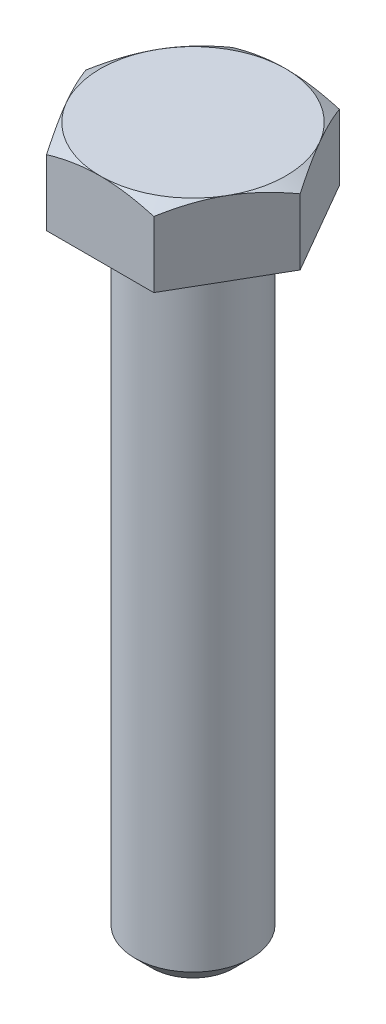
ISO-10303-21;
HEADER;
FILE_DESCRIPTION(('STEP AP214'),'2;1');
FILE_NAME('part.step','',(''),(''),'','','');
FILE_SCHEMA(('AUTOMOTIVE_DESIGN { 1 0 10303 214 1 1 1 1 }'));
ENDSEC;
DATA;
#1=APPLICATION_CONTEXT('core data for automotive mechanical design processes');
#2=APPLICATION_PROTOCOL_DEFINITION('international standard','automotive_design',2000,#1);
#3=PRODUCT_CONTEXT('',#1,'mechanical');
#4=PRODUCT('Part','Part','',(#3));
#5=PRODUCT_RELATED_PRODUCT_CATEGORY('part','',(#4));
#6=PRODUCT_DEFINITION_FORMATION('','',#4);
#7=PRODUCT_DEFINITION_CONTEXT('part definition',#1,'design');
#8=PRODUCT_DEFINITION('design','',#6,#7);
#9=PRODUCT_DEFINITION_SHAPE('','',#8);
#10=(LENGTH_UNIT() NAMED_UNIT(*) SI_UNIT(.MILLI.,.METRE.));
#11=(NAMED_UNIT(*) PLANE_ANGLE_UNIT() SI_UNIT($,.RADIAN.));
#12=(NAMED_UNIT(*) SI_UNIT($,.STERADIAN.) SOLID_ANGLE_UNIT());
#13=UNCERTAINTY_MEASURE_WITH_UNIT(LENGTH_MEASURE(1.E-05),#10,'distance_accuracy_value','');
#14=(GEOMETRIC_REPRESENTATION_CONTEXT(3) GLOBAL_UNCERTAINTY_ASSIGNED_CONTEXT((#13)) GLOBAL_UNIT_ASSIGNED_CONTEXT((#10,
#11,#12)) REPRESENTATION_CONTEXT('',''));
#15=CARTESIAN_POINT('',(0.,0.,0.));
#16=DIRECTION('',(0.,0.,1.));
#17=DIRECTION('',(1.,0.,0.));
#18=AXIS2_PLACEMENT_3D('',#15,#16,#17);
#19=CARTESIAN_POINT('',(0.,0.,0.));
#20=DIRECTION('',(0.,1.,0.));
#21=DIRECTION('',(0.,0.,1.));
#22=AXIS2_PLACEMENT_3D('',#19,#20,#21);
#23=PLANE('',#22);
#24=CARTESIAN_POINT('',(0.,0.,0.));
#25=DIRECTION('',(0.,1.,0.));
#26=DIRECTION('',(0.,0.,1.));
#27=AXIS2_PLACEMENT_3D('',#24,#25,#26);
#28=CIRCLE('',#27,5.);
#29=CARTESIAN_POINT('',(0.,0.,5.));
#30=VERTEX_POINT('',#29);
#31=EDGE_CURVE('E188',#30,#30,#28,.T.);
#32=ORIENTED_EDGE('',*,*,#31,.T.);
#33=EDGE_LOOP('',(#32));
#34=FACE_BOUND('',#33,.T.);
#35=DIRECTION('',(0.499999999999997,0.,0.86602540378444));
#36=VECTOR('',#35,1.);
#37=CARTESIAN_POINT('',(4.61880215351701,0.,-8.00000000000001));
#38=LINE('',#37,#36);
#39=CARTESIAN_POINT('',(4.61880215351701,0.,-8.00000000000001));
#40=VERTEX_POINT('',#39);
#41=CARTESIAN_POINT('',(9.23760430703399,0.,-2.27595720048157E-12));
#42=VERTEX_POINT('',#41);
#43=EDGE_CURVE('E125',#40,#42,#38,.T.);
#44=ORIENTED_EDGE('',*,*,#43,.T.);
#45=DIRECTION('',(-0.499999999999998,0.,0.86602540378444));
#46=VECTOR('',#45,1.);
#47=CARTESIAN_POINT('',(4.61880215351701,0.,8.00000000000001));
#48=LINE('',#47,#46);
#49=CARTESIAN_POINT('',(4.61880215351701,0.,8.00000000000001));
#50=VERTEX_POINT('',#49);
#51=EDGE_CURVE('E123',#42,#50,#48,.T.);
#52=ORIENTED_EDGE('',*,*,#51,.T.);
#53=DIRECTION('',(-1.,0.,0.));
#54=VECTOR('',#53,1.);
#55=CARTESIAN_POINT('',(-4.61880215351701,0.,7.99999999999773));
#56=LINE('',#55,#54);
#57=CARTESIAN_POINT('',(-4.61880215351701,0.,7.99999999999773));
#58=VERTEX_POINT('',#57);
#59=EDGE_CURVE('E53',#50,#58,#56,.T.);
#60=ORIENTED_EDGE('',*,*,#59,.T.);
#61=DIRECTION('',(-0.499999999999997,0.,-0.86602540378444));
#62=VECTOR('',#61,1.);
#63=CARTESIAN_POINT('',(-4.61880215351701,0.,7.99999999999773));
#64=LINE('',#63,#62);
#65=CARTESIAN_POINT('',(-9.23760430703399,5.68989300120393E-13,0.));
#66=VERTEX_POINT('',#65);
#67=EDGE_CURVE('E112',#58,#66,#64,.T.);
#68=ORIENTED_EDGE('',*,*,#67,.T.);
#69=DIRECTION('',(0.499999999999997,0.,-0.86602540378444));
#70=VECTOR('',#69,1.);
#71=CARTESIAN_POINT('',(-4.61880215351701,5.68989300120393E-13,-8.00000000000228));
#72=LINE('',#71,#70);
#73=CARTESIAN_POINT('',(-4.61880215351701,5.68989300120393E-13,-8.00000000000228));
#74=VERTEX_POINT('',#73);
#75=EDGE_CURVE('E118',#66,#74,#72,.T.);
#76=ORIENTED_EDGE('',*,*,#75,.T.);
#77=DIRECTION('',(1.,0.,0.));
#78=VECTOR('',#77,1.);
#79=CARTESIAN_POINT('',(-4.61880215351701,5.68989300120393E-13,-8.00000000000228));
#80=LINE('',#79,#78);
#81=EDGE_CURVE('E130',#74,#40,#80,.T.);
#82=ORIENTED_EDGE('',*,*,#81,.T.);
#83=EDGE_LOOP('',(#44,#52,#60,#68,#76,#82));
#84=FACE_BOUND('',#83,.T.);
#85=ADVANCED_FACE('F30',(#34,#84),#23,.F.);
#86=CARTESIAN_POINT('',(-1.13797860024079E-12,-55.,0.));
#87=DIRECTION('',(0.,1.,0.));
#88=DIRECTION('',(0.,0.,1.));
#89=AXIS2_PLACEMENT_3D('',#86,#87,#88);
#90=CYLINDRICAL_SURFACE('',#89,5.);
#91=CARTESIAN_POINT('',(0.,-53.5,0.));
#92=DIRECTION('',(0.,1.,0.));
#93=DIRECTION('',(0.,0.,1.));
#94=AXIS2_PLACEMENT_3D('',#91,#92,#93);
#95=CIRCLE('',#94,5.);
#96=CARTESIAN_POINT('',(0.,-53.5,5.));
#97=VERTEX_POINT('',#96);
#98=EDGE_CURVE('E38',#97,#97,#95,.T.);
#99=ORIENTED_EDGE('',*,*,#98,.T.);
#100=EDGE_LOOP('',(#99));
#101=FACE_BOUND('',#100,.T.);
#102=ORIENTED_EDGE('',*,*,#31,.F.);
#103=EDGE_LOOP('',(#102));
#104=FACE_BOUND('',#103,.T.);
#105=ADVANCED_FACE('F32',(#101,#104),#90,.T.);
#106=CARTESIAN_POINT('',(-1.13797860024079E-12,-55.,0.));
#107=DIRECTION('',(0.,1.,0.));
#108=DIRECTION('',(0.,0.,1.));
#109=AXIS2_PLACEMENT_3D('',#106,#107,#108);
#110=PLANE('',#109);
#111=CARTESIAN_POINT('',(-1.13797860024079E-12,-55.,0.));
#112=DIRECTION('',(0.,1.,0.));
#113=DIRECTION('',(0.,0.,1.));
#114=AXIS2_PLACEMENT_3D('',#111,#112,#113);
#115=CIRCLE('',#114,3.49999999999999);
#116=CARTESIAN_POINT('',(-1.13797860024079E-12,-55.,3.49999999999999));
#117=VERTEX_POINT('',#116);
#118=EDGE_CURVE('E11',#117,#117,#115,.F.);
#119=ORIENTED_EDGE('',*,*,#118,.T.);
#120=EDGE_LOOP('',(#119));
#121=FACE_BOUND('',#120,.T.);
#122=ADVANCED_FACE('F198',(#121),#110,.F.);
#123=CARTESIAN_POINT('',(0.,-53.5,0.));
#124=DIRECTION('',(0.,1.,0.));
#125=DIRECTION('',(0.,0.,1.));
#126=AXIS2_PLACEMENT_3D('',#123,#124,#125);
#127=CONICAL_SURFACE('',#126,5.,0.785398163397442);
#128=ORIENTED_EDGE('',*,*,#118,.F.);
#129=EDGE_LOOP('',(#128));
#130=FACE_BOUND('',#129,.T.);
#131=ORIENTED_EDGE('',*,*,#98,.F.);
#132=EDGE_LOOP('',(#131));
#133=FACE_BOUND('',#132,.T.);
#134=ADVANCED_FACE('F168',(#130,#133),#127,.T.);
#135=CARTESIAN_POINT('',(4.6188021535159,6.4,-8.00000000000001));
#136=DIRECTION('',(0.86602540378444,0.,-0.499999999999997));
#137=DIRECTION('',(-0.499999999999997,0.,-0.86602540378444));
#138=AXIS2_PLACEMENT_3D('',#135,#136,#137);
#139=PLANE('',#138);
#140=CARTESIAN_POINT('',(4.61868668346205,5.68540215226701,-8.00020000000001));
#141=CARTESIAN_POINT('',(4.72021302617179,5.74400928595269,-7.8243512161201));
#142=CARTESIAN_POINT('',(4.82211789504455,5.7999565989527,-7.64784680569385));
#143=CARTESIAN_POINT('',(5.02675523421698,5.90579899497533,-7.29340453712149));
#144=CARTESIAN_POINT('',(5.12948804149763,5.95569146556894,-7.11546609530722));
#145=CARTESIAN_POINT('',(5.43933133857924,6.09530720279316,-6.5788017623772));
#146=CARTESIAN_POINT('',(5.64766491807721,6.17471882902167,-6.21795741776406));
#147=CARTESIAN_POINT('',(5.95943209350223,6.26783835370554,-5.67796082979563));
#148=CARTESIAN_POINT('',(6.06193429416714,6.2943654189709,-5.50042181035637));
#149=CARTESIAN_POINT('',(6.26740224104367,6.33884682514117,-5.14454088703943));
#150=CARTESIAN_POINT('',(6.3703679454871,6.35680192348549,-4.9661990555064));
#151=CARTESIAN_POINT('',(6.57647664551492,6.3836843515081,-4.60920831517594));
#152=CARTESIAN_POINT('',(6.67961930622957,6.3926219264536,-4.43055998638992));
#153=CARTESIAN_POINT('',(6.88599991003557,6.40127769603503,-4.07309829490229));
#154=CARTESIAN_POINT('',(6.98923785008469,6.40099617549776,-3.89428493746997));
#155=CARTESIAN_POINT('',(7.18224506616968,6.39185497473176,-3.55998663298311));
#156=CARTESIAN_POINT('',(7.27202796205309,6.38411039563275,-3.40447809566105));
#157=CARTESIAN_POINT('',(7.45138347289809,6.36179886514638,-3.09382523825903));
#158=CARTESIAN_POINT('',(7.54095607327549,6.34723145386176,-2.93868094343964));
#159=CARTESIAN_POINT('',(7.80932710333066,6.29363930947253,-2.47384868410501));
#160=CARTESIAN_POINT('',(7.98765049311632,6.24473135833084,-2.16498351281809));
#161=CARTESIAN_POINT('',(8.34618890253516,6.12246059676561,-1.54397677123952));
#162=CARTESIAN_POINT('',(8.52635816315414,6.04857947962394,-1.23191445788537));
#163=CARTESIAN_POINT('',(8.88400987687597,5.88089985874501,-0.612443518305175));
#164=CARTESIAN_POINT('',(9.0614969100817,5.78714073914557,-0.305026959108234));
#165=CARTESIAN_POINT('',(9.23771977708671,5.68540215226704,0.000200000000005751));
#166=B_SPLINE_CURVE_WITH_KNOTS('',3,(#140,#141,#142,#143,#144,#145,#146,#147,#148,#149,#150,
#151,#152,#153,#154,#155,#156,#157,#158,#159,#160,#161,#162,#163,#164,#165),.UNSPECIFIED.,.F.,
.F.,(4,2,2,2,2,2,2,2,2,2,2,2,4),(0.,0.63397354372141,1.26821965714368,2.53934712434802,
3.15934343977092,3.77928496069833,4.3985213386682,5.01773858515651,5.55680239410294,
6.09590254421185,7.17487077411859,8.2777685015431,9.37850115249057),.UNSPECIFIED.);
#167=CARTESIAN_POINT('',(4.6188021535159,5.68546882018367,-8.00000000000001));
#168=VERTEX_POINT('',#167);
#169=CARTESIAN_POINT('',(6.92820323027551,6.40000000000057,-4.));
#170=VERTEX_POINT('',#169);
#171=EDGE_CURVE('E177',#168,#170,#166,.T.);
#172=ORIENTED_EDGE('',*,*,#171,.T.);
#173=CARTESIAN_POINT('',(9.23760430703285,5.68546882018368,0.));
#174=VERTEX_POINT('',#173);
#175=EDGE_CURVE('E171',#170,#174,#166,.T.);
#176=ORIENTED_EDGE('',*,*,#175,.T.);
#177=DIRECTION('',(0.,-1.,0.));
#178=VECTOR('',#177,1.);
#179=CARTESIAN_POINT('',(9.23760430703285,6.4,0.));
#180=LINE('',#179,#178);
#181=EDGE_CURVE('E133',#174,#42,#180,.T.);
#182=ORIENTED_EDGE('',*,*,#181,.T.);
#183=ORIENTED_EDGE('',*,*,#43,.F.);
#184=DIRECTION('',(0.,-1.,0.));
#185=VECTOR('',#184,1.);
#186=CARTESIAN_POINT('',(4.6188021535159,6.4,-8.00000000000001));
#187=LINE('',#186,#185);
#188=EDGE_CURVE('E134',#168,#40,#187,.T.);
#189=ORIENTED_EDGE('',*,*,#188,.F.);
#190=EDGE_LOOP('',(#172,#176,#182,#183,#189));
#191=FACE_BOUND('',#190,.T.);
#192=ADVANCED_FACE('F164',(#191),#139,.T.);
#193=CARTESIAN_POINT('',(-4.61880215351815,6.40000000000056,-8.00000000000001));
#194=DIRECTION('',(0.,0.,-1.));
#195=DIRECTION('',(-1.,0.,0.));
#196=AXIS2_PLACEMENT_3D('',#193,#194,#195);
#197=PLANE('',#196);
#198=CARTESIAN_POINT('',(-12.4167804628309,2.49087866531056,-8.00000000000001));
#199=CARTESIAN_POINT('',(-12.0672904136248,2.66045330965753,-8.00000000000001));
#200=CARTESIAN_POINT('',(-11.7169991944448,2.82840496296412,-8.00000000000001));
#201=CARTESIAN_POINT('',(-11.0143883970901,3.16014971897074,-8.00000000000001));
#202=CARTESIAN_POINT('',(-10.6620685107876,3.32394216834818,-8.00000000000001));
#203=CARTESIAN_POINT('',(-9.95316388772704,3.64727784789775,-8.00000000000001));
#204=CARTESIAN_POINT('',(-9.59656638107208,3.80679317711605,-8.00000000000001));
#205=CARTESIAN_POINT('',(-8.88053881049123,4.11930971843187,-8.00000000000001));
#206=CARTESIAN_POINT('',(-8.52110888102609,4.27231123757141,-8.));
#207=CARTESIAN_POINT('',(-7.78718796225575,4.57488649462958,-8.00000000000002));
#208=CARTESIAN_POINT('',(-7.41258513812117,4.72419046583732,-8.00000000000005));
#209=CARTESIAN_POINT('',(-6.65900148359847,5.01152306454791,-7.99999999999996));
#210=CARTESIAN_POINT('',(-6.2800201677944,5.14955042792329,-7.99999999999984));
#211=CARTESIAN_POINT('',(-5.51777814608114,5.41071323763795,-8.00000000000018));
#212=CARTESIAN_POINT('',(-5.13452785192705,5.53387874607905,-8.00000000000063));
#213=CARTESIAN_POINT('',(-4.362543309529,5.76137385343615,-7.99999999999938));
#214=CARTESIAN_POINT('',(-3.97381082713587,5.86570937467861,-7.99999999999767));
#215=CARTESIAN_POINT('',(-3.19274508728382,6.04997949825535,-7.99999999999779));
#216=CARTESIAN_POINT('',(-2.80044412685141,6.13004730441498,-7.9999999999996));
#217=CARTESIAN_POINT('',(-2.20841205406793,6.22848907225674,-8.00000000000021));
#218=CARTESIAN_POINT('',(-2.01045675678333,6.25769433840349,-8.00000000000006));
#219=CARTESIAN_POINT('',(-1.6135587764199,6.30831227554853,-7.99999999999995));
#220=CARTESIAN_POINT('',(-1.41461619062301,6.32972569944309,-7.99999999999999));
#221=CARTESIAN_POINT('',(-1.01861322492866,6.36406427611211,-8.00000000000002));
#222=CARTESIAN_POINT('',(-0.821562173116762,6.37709657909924,-8.00000000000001));
#223=CARTESIAN_POINT('',(-0.427085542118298,6.39481615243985,-8.));
#224=CARTESIAN_POINT('',(-0.229659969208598,6.39950356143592,-8.00000000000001));
#225=CARTESIAN_POINT('',(0.165212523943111,6.40042150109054,-8.00000000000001));
#226=CARTESIAN_POINT('',(0.362659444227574,6.39665201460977,-8.00000000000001));
#227=CARTESIAN_POINT('',(0.757218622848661,6.38074842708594,-8.00000000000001));
#228=CARTESIAN_POINT('',(0.954330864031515,6.3686139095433,-8.00000000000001));
#229=CARTESIAN_POINT('',(1.42775543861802,6.32968039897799,-8.00000000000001));
#230=CARTESIAN_POINT('',(1.70374960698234,6.29892889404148,-8.00000000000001));
#231=CARTESIAN_POINT('',(2.25368309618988,6.2227015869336,-8.00000000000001));
#232=CARTESIAN_POINT('',(2.52762213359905,6.1772237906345,-8.00000000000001));
#233=CARTESIAN_POINT('',(3.34604792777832,6.02111296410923,-8.00000000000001));
#234=CARTESIAN_POINT('',(3.88683599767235,5.8908311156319,-8.00000000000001));
#235=CARTESIAN_POINT('',(4.69544521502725,5.66499176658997,-8.00000000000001));
#236=CARTESIAN_POINT('',(4.96746298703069,5.58359647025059,-8.00000000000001));
#237=CARTESIAN_POINT('',(5.50885654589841,5.41237041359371,-8.00000000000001));
#238=CARTESIAN_POINT('',(5.77823231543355,5.32253959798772,-8.00000000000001));
#239=CARTESIAN_POINT('',(6.31442665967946,5.13588222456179,-8.00000000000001));
#240=CARTESIAN_POINT('',(6.58124604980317,5.03905798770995,-8.00000000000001));
#241=CARTESIAN_POINT('',(7.11267570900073,4.83955111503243,-8.00000000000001));
#242=CARTESIAN_POINT('',(7.3772860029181,4.73686854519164,-8.00000000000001));
#243=CARTESIAN_POINT('',(7.99738819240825,4.48959410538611,-8.00000000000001));
#244=CARTESIAN_POINT('',(8.3520710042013,4.34297712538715,-8.00000000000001));
#245=CARTESIAN_POINT('',(9.05844726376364,4.04269024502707,-8.));
#246=CARTESIAN_POINT('',(9.41014053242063,3.88901992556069,-8.));
#247=CARTESIAN_POINT('',(10.1110881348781,3.57602605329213,-8.));
#248=CARTESIAN_POINT('',(10.460341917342,3.41670126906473,-8.));
#249=CARTESIAN_POINT('',(11.1567365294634,3.09352849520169,-8.));
#250=CARTESIAN_POINT('',(11.5038774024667,2.92968059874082,-8.));
#251=CARTESIAN_POINT('',(12.1967663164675,2.59812346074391,-8.));
#252=CARTESIAN_POINT('',(12.5425124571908,2.43041025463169,-8.));
#253=CARTESIAN_POINT('',(13.2325146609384,2.09194333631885,-8.));
#254=CARTESIAN_POINT('',(13.5767707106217,1.92118959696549,-8.));
#255=CARTESIAN_POINT('',(14.6075666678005,1.40521482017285,-8.));
#256=CARTESIAN_POINT('',(15.2922255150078,1.05623625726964,-8.00000000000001));
#257=CARTESIAN_POINT('',(16.6012396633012,0.380458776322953,-8.));
#258=CARTESIAN_POINT('',(17.2258861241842,0.0542213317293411,-7.99999999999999));
#259=CARTESIAN_POINT('',(18.4728403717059,-0.602741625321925,-8.00000000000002));
#260=CARTESIAN_POINT('',(19.0951480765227,-0.933467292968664,-8.00000000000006));
#261=CARTESIAN_POINT('',(20.3364010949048,-1.59751993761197,-7.99999999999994));
#262=CARTESIAN_POINT('',(20.9553509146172,-1.9308385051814,-7.99999999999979));
#263=CARTESIAN_POINT('',(22.1917524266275,-2.6001635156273,-8.00000000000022));
#264=CARTESIAN_POINT('',(22.8092041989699,-2.93616981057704,-8.0000000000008));
#265=CARTESIAN_POINT('',(23.4261034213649,-3.27318069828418,-8.00000000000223));
#266=B_SPLINE_CURVE_WITH_KNOTS('',3,(#198,#199,#200,#201,#202,#203,#204,#205,#206,#207,#208,
#209,#210,#211,#212,#213,#214,#215,#216,#217,#218,#219,#220,#221,#222,#223,#224,#225,#226,#227,
#228,#229,#230,#231,#232,#233,#234,#235,#236,#237,#238,#239,#240,#241,#242,#243,#244,#245,#246,
#247,#248,#249,#250,#251,#252,#253,#254,#255,#256,#257,#258,#259,#260,#261,#262,#263,#264,#265),
.UNSPECIFIED.,.F.,.F.,(4,2,2,2,2,2,2,2,2,2,2,2,2,2,2,2,2,2,2,2,2,2,2,2,2,2,2,2,2,2,2,2,2,4),(0.,
1.16538522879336,2.33095239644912,3.50284826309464,4.6746888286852,5.88432915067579,
7.09410488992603,8.30139098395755,9.50829670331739,10.7084525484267,11.3086176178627,
11.9087246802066,12.5009984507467,13.0932623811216,13.6855275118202,14.2778221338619,
15.1104579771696,15.9432066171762,17.6096258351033,18.461358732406,19.3130972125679,
20.1645543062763,21.0160018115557,22.167276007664,23.3186187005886,24.4702136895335,
25.6217849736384,26.7745951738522,27.927415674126,30.2327531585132,32.3468591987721,
34.4610385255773,36.5700125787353,38.6788713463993),.UNSPECIFIED.);
#267=CARTESIAN_POINT('',(-4.61880215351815,5.68546882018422,-8.00000000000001));
#268=VERTEX_POINT('',#267);
#269=CARTESIAN_POINT('',(-1.13797860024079E-12,6.4,-8.00000000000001));
#270=VERTEX_POINT('',#269);
#271=EDGE_CURVE('E178',#268,#270,#266,.T.);
#272=ORIENTED_EDGE('',*,*,#271,.T.);
#273=EDGE_CURVE('E179',#270,#168,#266,.T.);
#274=ORIENTED_EDGE('',*,*,#273,.T.);
#275=ORIENTED_EDGE('',*,*,#188,.T.);
#276=ORIENTED_EDGE('',*,*,#81,.F.);
#277=DIRECTION('',(0.,-1.,0.));
#278=VECTOR('',#277,1.);
#279=CARTESIAN_POINT('',(-4.61880215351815,6.40000000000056,-8.00000000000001));
#280=LINE('',#279,#278);
#281=EDGE_CURVE('E137',#268,#74,#280,.T.);
#282=ORIENTED_EDGE('',*,*,#281,.F.);
#283=EDGE_LOOP('',(#272,#274,#275,#276,#282));
#284=FACE_BOUND('',#283,.T.);
#285=ADVANCED_FACE('F167',(#284),#197,.T.);
#286=CARTESIAN_POINT('',(-4.61880215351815,6.40000000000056,-8.00000000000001));
#287=DIRECTION('',(-0.86602540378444,0.,-0.499999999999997));
#288=DIRECTION('',(-0.499999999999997,0.,0.86602540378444));
#289=AXIS2_PLACEMENT_3D('',#286,#287,#288);
#290=PLANE('',#289);
#291=CARTESIAN_POINT('',(-9.23771977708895,5.68540215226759,0.000200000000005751));
#292=CARTESIAN_POINT('',(-9.13619343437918,5.74400928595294,-0.175648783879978));
#293=CARTESIAN_POINT('',(-9.03428856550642,5.79995659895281,-0.352153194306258));
#294=CARTESIAN_POINT('',(-8.82965122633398,5.90579899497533,-0.706595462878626));
#295=CARTESIAN_POINT('',(-8.72691841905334,5.95569146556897,-0.88453390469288));
#296=CARTESIAN_POINT('',(-8.41707512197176,6.09530720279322,-1.42119823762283));
#297=CARTESIAN_POINT('',(-8.20874154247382,6.17471882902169,-1.78204258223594));
#298=CARTESIAN_POINT('',(-7.89697436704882,6.26783835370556,-2.32203917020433));
#299=CARTESIAN_POINT('',(-7.79447216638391,6.29436541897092,-2.49957818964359));
#300=CARTESIAN_POINT('',(-7.58900421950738,6.33884682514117,-2.85545911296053));
#301=CARTESIAN_POINT('',(-7.48603851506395,6.35680192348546,-3.03380094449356));
#302=CARTESIAN_POINT('',(-7.27992981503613,6.38368435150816,-3.39079168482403));
#303=CARTESIAN_POINT('',(-7.17678715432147,6.39262192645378,-3.56944001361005));
#304=CARTESIAN_POINT('',(-6.97040655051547,6.40127769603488,-3.92690170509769));
#305=CARTESIAN_POINT('',(-6.86716861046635,6.40099617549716,-4.10571506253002));
#306=CARTESIAN_POINT('',(-6.67416139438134,6.39185497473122,-4.44001336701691));
#307=CARTESIAN_POINT('',(-6.58437849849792,6.38411039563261,-4.59552190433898));
#308=CARTESIAN_POINT('',(-6.4050229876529,6.36179886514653,-4.90617476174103));
#309=CARTESIAN_POINT('',(-6.31545038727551,6.34723145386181,-5.06131905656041));
#310=CARTESIAN_POINT('',(-6.04707935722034,6.29363930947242,-5.52615131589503));
#311=CARTESIAN_POINT('',(-5.86875596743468,6.24473135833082,-5.83501648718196));
#312=CARTESIAN_POINT('',(-5.51021755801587,6.12246059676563,-6.45602322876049));
#313=CARTESIAN_POINT('',(-5.33004829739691,6.04857947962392,-6.76808554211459));
#314=CARTESIAN_POINT('',(-4.97239658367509,5.88089985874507,-7.38755648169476));
#315=CARTESIAN_POINT('',(-4.79490955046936,5.78714073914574,-7.69497304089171));
#316=CARTESIAN_POINT('',(-4.61868668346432,5.68540215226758,-8.00020000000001));
#317=B_SPLINE_CURVE_WITH_KNOTS('',3,(#291,#292,#293,#294,#295,#296,#297,#298,#299,#300,#301,
#302,#303,#304,#305,#306,#307,#308,#309,#310,#311,#312,#313,#314,#315,#316),.UNSPECIFIED.,.F.,
.F.,(4,2,2,2,2,2,2,2,2,2,2,2,4),(0.,0.633973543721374,1.26821965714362,2.53934712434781,
3.1593434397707,3.77928496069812,4.398521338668,5.01773858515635,5.55680239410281,
6.09590254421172,7.17487077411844,8.27776850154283,9.37850115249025),.UNSPECIFIED.);
#318=CARTESIAN_POINT('',(-9.23760430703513,5.68546882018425,0.));
#319=VERTEX_POINT('',#318);
#320=CARTESIAN_POINT('',(-6.92820323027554,6.4,-4.));
#321=VERTEX_POINT('',#320);
#322=EDGE_CURVE('E315',#319,#321,#317,.T.);
#323=ORIENTED_EDGE('',*,*,#322,.T.);
#324=EDGE_CURVE('E311',#321,#268,#317,.T.);
#325=ORIENTED_EDGE('',*,*,#324,.T.);
#326=ORIENTED_EDGE('',*,*,#281,.T.);
#327=ORIENTED_EDGE('',*,*,#75,.F.);
#328=DIRECTION('',(0.,-1.,0.));
#329=VECTOR('',#328,1.);
#330=CARTESIAN_POINT('',(-9.23760430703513,6.40000000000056,0.));
#331=LINE('',#330,#329);
#332=EDGE_CURVE('E108',#319,#66,#331,.T.);
#333=ORIENTED_EDGE('',*,*,#332,.F.);
#334=EDGE_LOOP('',(#323,#325,#326,#327,#333));
#335=FACE_BOUND('',#334,.T.);
#336=ADVANCED_FACE('F280',(#335),#290,.T.);
#337=CARTESIAN_POINT('',(-4.61880215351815,6.4,7.99999999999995));
#338=DIRECTION('',(-0.86602540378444,0.,0.499999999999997));
#339=DIRECTION('',(0.499999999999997,0.,0.86602540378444));
#340=AXIS2_PLACEMENT_3D('',#337,#338,#339);
#341=PLANE('',#340);
#342=CARTESIAN_POINT('',(-4.61868668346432,5.68540215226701,8.00019999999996));
#343=CARTESIAN_POINT('',(-4.72021302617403,5.7440092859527,7.82435121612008));
#344=CARTESIAN_POINT('',(-4.82211789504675,5.79995659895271,7.64784680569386));
#345=CARTESIAN_POINT('',(-5.02675523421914,5.90579899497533,7.29340453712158));
#346=CARTESIAN_POINT('',(-5.12948804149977,5.95569146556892,7.11546609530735));
#347=CARTESIAN_POINT('',(-5.43933133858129,6.09530720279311,6.57880176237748));
#348=CARTESIAN_POINT('',(-5.64766491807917,6.1747188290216,6.21795741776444));
#349=CARTESIAN_POINT('',(-5.95943209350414,6.26783835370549,5.67796082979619));
#350=CARTESIAN_POINT('',(-6.06193429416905,6.29436541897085,5.50042181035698));
#351=CARTESIAN_POINT('',(-6.26740224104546,6.33884682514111,5.14454088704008));
#352=CARTESIAN_POINT('',(-6.37036794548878,6.3568019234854,4.96619905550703));
#353=CARTESIAN_POINT('',(-6.57647664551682,6.38368435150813,4.60920831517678));
#354=CARTESIAN_POINT('',(-6.6796193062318,6.39262192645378,4.43055998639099));
#355=CARTESIAN_POINT('',(-6.88599991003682,6.40127769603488,4.07309829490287));
#356=CARTESIAN_POINT('',(-6.98923785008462,6.40099617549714,3.89428493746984));
#357=CARTESIAN_POINT('',(-7.18224506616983,6.39185497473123,3.55998663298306));
#358=CARTESIAN_POINT('',(-7.27202796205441,6.38411039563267,3.4044780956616));
#359=CARTESIAN_POINT('',(-7.45138347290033,6.36179886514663,3.09382523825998));
#360=CARTESIAN_POINT('',(-7.54095607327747,6.34723145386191,2.9386809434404));
#361=CARTESIAN_POINT('',(-7.80932710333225,6.29363930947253,2.4738486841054));
#362=CARTESIAN_POINT('',(-7.98765049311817,6.24473135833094,2.16498351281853));
#363=CARTESIAN_POINT('',(-8.34618890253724,6.12246059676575,1.54397677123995));
#364=CARTESIAN_POINT('',(-8.5263581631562,6.04857947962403,1.23191445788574));
#365=CARTESIAN_POINT('',(-8.88400987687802,5.88089985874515,0.612443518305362));
#366=CARTESIAN_POINT('',(-9.06149691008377,5.78714073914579,0.305026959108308));
#367=CARTESIAN_POINT('',(-9.23771977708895,5.68540215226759,-0.000200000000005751));
#368=B_SPLINE_CURVE_WITH_KNOTS('',3,(#342,#343,#344,#345,#346,#347,#348,#349,#350,#351,#352,
#353,#354,#355,#356,#357,#358,#359,#360,#361,#362,#363,#364,#365,#366,#367),.UNSPECIFIED.,.F.,
.F.,(4,2,2,2,2,2,2,2,2,2,2,2,4),(0.,0.633973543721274,1.26821965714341,2.53934712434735,
3.15934343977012,3.77928496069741,4.39852133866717,5.0177385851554,5.55680239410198,
6.09590254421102,7.174870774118,8.27776850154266,9.37850115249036),.UNSPECIFIED.);
#369=CARTESIAN_POINT('',(-4.61880215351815,5.68546882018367,7.99999999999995));
#370=VERTEX_POINT('',#369);
#371=CARTESIAN_POINT('',(-6.92820323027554,6.4,3.99999999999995));
#372=VERTEX_POINT('',#371);
#373=EDGE_CURVE('E309',#370,#372,#368,.T.);
#374=ORIENTED_EDGE('',*,*,#373,.T.);
#375=EDGE_CURVE('E305',#372,#319,#368,.T.);
#376=ORIENTED_EDGE('',*,*,#375,.T.);
#377=ORIENTED_EDGE('',*,*,#332,.T.);
#378=ORIENTED_EDGE('',*,*,#67,.F.);
#379=DIRECTION('',(0.,-1.,0.));
#380=VECTOR('',#379,1.);
#381=CARTESIAN_POINT('',(-4.61880215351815,6.4,7.99999999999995));
#382=LINE('',#381,#380);
#383=EDGE_CURVE('E101',#370,#58,#382,.T.);
#384=ORIENTED_EDGE('',*,*,#383,.F.);
#385=EDGE_LOOP('',(#374,#376,#377,#378,#384));
#386=FACE_BOUND('',#385,.T.);
#387=ADVANCED_FACE('F113',(#386),#341,.T.);
#388=CARTESIAN_POINT('',(-4.61880215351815,6.4,7.99999999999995));
#389=DIRECTION('',(0.,0.,1.));
#390=DIRECTION('',(1.,0.,0.));
#391=AXIS2_PLACEMENT_3D('',#388,#389,#390);
#392=PLANE('',#391);
#393=CARTESIAN_POINT('',(-12.4167804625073,2.49087866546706,8.00000000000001));
#394=CARTESIAN_POINT('',(-12.0672904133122,2.66045330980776,7.99999999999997));
#395=CARTESIAN_POINT('',(-11.7169991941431,2.82840496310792,7.99999999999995));
#396=CARTESIAN_POINT('',(-11.0143883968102,3.16014971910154,7.99999999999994));
#397=CARTESIAN_POINT('',(-10.6620685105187,3.32394216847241,7.99999999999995));
#398=CARTESIAN_POINT('',(-9.95316388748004,3.6472778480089,7.99999999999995));
#399=CARTESIAN_POINT('',(-9.59656638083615,3.80679317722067,7.99999999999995));
#400=CARTESIAN_POINT('',(-8.88053881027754,4.11930971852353,7.99999999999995));
#401=CARTESIAN_POINT('',(-8.52110888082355,4.27231123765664,7.99999999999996));
#402=CARTESIAN_POINT('',(-7.78718796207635,4.5748864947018,7.99999999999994));
#403=CARTESIAN_POINT('',(-7.41258513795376,4.72419046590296,7.99999999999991));
#404=CARTESIAN_POINT('',(-6.65900148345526,5.01152306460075,8.));
#405=CARTESIAN_POINT('',(-6.28002016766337,5.14955042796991,8.00000000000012));
#406=CARTESIAN_POINT('',(-5.51777814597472,5.41071323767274,7.99999999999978));
#407=CARTESIAN_POINT('',(-5.13452785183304,5.53387874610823,7.99999999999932));
#408=CARTESIAN_POINT('',(-4.36254330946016,5.76137385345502,8.00000000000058));
#409=CARTESIAN_POINT('',(-3.97381082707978,5.86570937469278,8.00000000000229));
#410=CARTESIAN_POINT('',(-3.1927450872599,6.04997949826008,8.00000000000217));
#411=CARTESIAN_POINT('',(-2.800444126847,6.13004730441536,8.00000000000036));
#412=CARTESIAN_POINT('',(-2.20841205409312,6.22848907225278,7.99999999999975));
#413=CARTESIAN_POINT('',(-2.01045675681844,6.25769433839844,7.9999999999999));
#414=CARTESIAN_POINT('',(-1.61355877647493,6.30831227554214,8.00000000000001));
#415=CARTESIAN_POINT('',(-1.41461619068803,6.32972569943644,7.99999999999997));
#416=CARTESIAN_POINT('',(-1.01861322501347,6.36406427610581,7.99999999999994));
#417=CARTESIAN_POINT('',(-0.821562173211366,6.37709657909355,7.99999999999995));
#418=CARTESIAN_POINT('',(-0.427085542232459,6.39481615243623,7.99999999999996));
#419=CARTESIAN_POINT('',(-0.229659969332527,6.39950356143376,7.99999999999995));
#420=CARTESIAN_POINT('',(0.165212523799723,6.40042150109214,7.99999999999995));
#421=CARTESIAN_POINT('',(0.362659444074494,6.39665201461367,7.99999999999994));
#422=CARTESIAN_POINT('',(0.757218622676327,6.38074842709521,7.99999999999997));
#423=CARTESIAN_POINT('',(0.954330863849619,6.36861390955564,8.));
#424=CARTESIAN_POINT('',(1.42775543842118,6.3296803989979,8.00000000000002));
#425=CARTESIAN_POINT('',(1.70374960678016,6.29892889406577,7.99999999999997));
#426=CARTESIAN_POINT('',(2.25368309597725,6.22270158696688,7.99999999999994));
#427=CARTESIAN_POINT('',(2.52762213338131,6.17722379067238,7.99999999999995));
#428=CARTESIAN_POINT('',(3.34604792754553,6.02111296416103,7.99999999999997));
#429=CARTESIAN_POINT('',(3.88683599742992,5.89083111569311,7.99999999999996));
#430=CARTESIAN_POINT('',(4.69544521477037,5.66499176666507,7.99999999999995));
#431=CARTESIAN_POINT('',(4.96746298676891,5.58359647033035,7.99999999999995));
#432=CARTESIAN_POINT('',(5.50885654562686,5.41237041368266,7.99999999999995));
#433=CARTESIAN_POINT('',(5.77823231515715,5.3225395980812,7.99999999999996));
#434=CARTESIAN_POINT('',(6.31442665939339,5.13588222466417,7.99999999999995));
#435=CARTESIAN_POINT('',(6.58124604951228,5.0390579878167,7.99999999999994));
#436=CARTESIAN_POINT('',(7.11267570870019,4.83955111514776,7.99999999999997));
#437=CARTESIAN_POINT('',(7.37728600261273,4.73686854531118,8.));
#438=CARTESIAN_POINT('',(7.99738819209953,4.48959410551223,8.00000000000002));
#439=CARTESIAN_POINT('',(8.35207100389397,4.34297712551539,7.99999999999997));
#440=CARTESIAN_POINT('',(9.05844726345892,4.04269024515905,7.99999999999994));
#441=CARTESIAN_POINT('',(9.41014053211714,3.88901992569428,7.99999999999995));
#442=CARTESIAN_POINT('',(10.1110881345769,3.57602605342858,7.99999999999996));
#443=CARTESIAN_POINT('',(10.4603419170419,3.41670126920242,7.99999999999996));
#444=CARTESIAN_POINT('',(11.1567365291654,3.09352849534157,7.99999999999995));
#445=CARTESIAN_POINT('',(11.5038774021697,2.92968059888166,7.99999999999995));
#446=CARTESIAN_POINT('',(12.1967663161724,2.59812346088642,7.99999999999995));
#447=CARTESIAN_POINT('',(12.5425124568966,2.43041025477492,7.99999999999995));
#448=CARTESIAN_POINT('',(13.2325146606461,2.09194333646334,7.99999999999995));
#449=CARTESIAN_POINT('',(13.5767707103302,1.92118959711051,7.99999999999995));
#450=CARTESIAN_POINT('',(14.6075666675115,1.40521482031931,7.99999999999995));
#451=CARTESIAN_POINT('',(15.2922255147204,1.05623625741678,7.99999999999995));
#452=CARTESIAN_POINT('',(16.6012396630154,0.380458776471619,7.99999999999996));
#453=CARTESIAN_POINT('',(17.2258861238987,0.054221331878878,7.99999999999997));
#454=CARTESIAN_POINT('',(18.4728403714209,-0.602741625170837,7.99999999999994));
#455=CARTESIAN_POINT('',(19.0951480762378,-0.933467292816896,7.9999999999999));
#456=CARTESIAN_POINT('',(20.3364010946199,-1.59751993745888,8.00000000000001));
#457=CARTESIAN_POINT('',(20.9553509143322,-1.93083850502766,8.00000000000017));
#458=CARTESIAN_POINT('',(22.1917524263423,-2.60016351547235,7.99999999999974));
#459=CARTESIAN_POINT('',(22.8092041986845,-2.93616981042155,7.99999999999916));
#460=CARTESIAN_POINT('',(23.4261034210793,-3.27318069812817,7.99999999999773));
#461=B_SPLINE_CURVE_WITH_KNOTS('',3,(#393,#394,#395,#396,#397,#398,#399,#400,#401,#402,#403,
#404,#405,#406,#407,#408,#409,#410,#411,#412,#413,#414,#415,#416,#417,#418,#419,#420,#421,#422,
#423,#424,#425,#426,#427,#428,#429,#430,#431,#432,#433,#434,#435,#436,#437,#438,#439,#440,#441,
#442,#443,#444,#445,#446,#447,#448,#449,#450,#451,#452,#453,#454,#455,#456,#457,#458,#459,#460),
.UNSPECIFIED.,.F.,.F.,(4,2,2,2,2,2,2,2,2,2,2,2,2,2,2,2,2,2,2,2,2,2,2,2,2,2,2,2,2,2,2,2,2,4),(0.,
1.16538522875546,2.33095239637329,3.50284826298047,4.67468882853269,5.88432915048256,
7.09410488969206,8.30139098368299,9.50829670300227,10.7084525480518,11.3086176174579,
11.9087246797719,12.5009984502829,13.0932623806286,13.685527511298,14.2778221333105,
15.1104579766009,15.9432066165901,17.6096258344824,18.4613587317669,19.3130972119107,
20.164554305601,21.0160018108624,22.1672760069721,23.3186186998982,24.4702136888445,
25.6217849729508,26.7745951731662,27.9274156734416,30.2327531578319,32.3468591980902,
34.4610385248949,36.5700125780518,38.6788713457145),.UNSPECIFIED.);
#462=CARTESIAN_POINT('',(4.6188021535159,5.68546882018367,8.00000000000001));
#463=VERTEX_POINT('',#462);
#464=CARTESIAN_POINT('',(-1.13797860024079E-12,6.4,8.00000000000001));
#465=VERTEX_POINT('',#464);
#466=EDGE_CURVE('E310',#463,#465,#461,.F.);
#467=ORIENTED_EDGE('',*,*,#466,.T.);
#468=EDGE_CURVE('E105',#465,#370,#461,.F.);
#469=ORIENTED_EDGE('',*,*,#468,.T.);
#470=ORIENTED_EDGE('',*,*,#383,.T.);
#471=ORIENTED_EDGE('',*,*,#59,.F.);
#472=DIRECTION('',(0.,-1.,0.));
#473=VECTOR('',#472,1.);
#474=CARTESIAN_POINT('',(4.6188021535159,6.4,8.00000000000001));
#475=LINE('',#474,#473);
#476=EDGE_CURVE('E109',#463,#50,#475,.T.);
#477=ORIENTED_EDGE('',*,*,#476,.F.);
#478=EDGE_LOOP('',(#467,#469,#470,#471,#477));
#479=FACE_BOUND('',#478,.T.);
#480=ADVANCED_FACE('F103',(#479),#392,.T.);
#481=CARTESIAN_POINT('',(4.6188021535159,6.4,8.00000000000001));
#482=DIRECTION('',(0.86602540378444,0.,0.499999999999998));
#483=DIRECTION('',(0.499999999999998,0.,-0.86602540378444));
#484=AXIS2_PLACEMENT_3D('',#481,#482,#483);
#485=PLANE('',#484);
#486=CARTESIAN_POINT('',(9.23771977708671,5.68540215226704,-0.000200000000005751));
#487=CARTESIAN_POINT('',(9.136193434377,5.74400928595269,0.175648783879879));
#488=CARTESIAN_POINT('',(9.03428856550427,5.79995659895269,0.3521531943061));
#489=CARTESIAN_POINT('',(8.82965122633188,5.9057989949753,0.706595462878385));
#490=CARTESIAN_POINT('',(8.72691841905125,5.9556914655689,0.884533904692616));
#491=CARTESIAN_POINT('',(8.41707512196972,6.09530720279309,1.42119823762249));
#492=CARTESIAN_POINT('',(8.20874154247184,6.17471882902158,1.78204258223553));
#493=CARTESIAN_POINT('',(7.89697436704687,6.26783835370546,2.32203917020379));
#494=CARTESIAN_POINT('',(7.79447216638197,6.29436541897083,2.49957818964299));
#495=CARTESIAN_POINT('',(7.58900421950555,6.33884682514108,2.85545911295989));
#496=CARTESIAN_POINT('',(7.48603851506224,6.35680192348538,3.03380094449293));
#497=CARTESIAN_POINT('',(7.2799298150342,6.3836843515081,3.39079168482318));
#498=CARTESIAN_POINT('',(7.17678715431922,6.39262192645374,3.56944001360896));
#499=CARTESIAN_POINT('',(6.97040655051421,6.40127769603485,3.92690170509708));
#500=CARTESIAN_POINT('',(6.86716861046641,6.40099617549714,4.10571506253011));
#501=CARTESIAN_POINT('',(6.6741613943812,6.39185497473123,4.4400133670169));
#502=CARTESIAN_POINT('',(6.58437849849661,6.38411039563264,4.59552190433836));
#503=CARTESIAN_POINT('',(6.40502298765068,6.36179886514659,4.90617476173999));
#504=CARTESIAN_POINT('',(6.31545038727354,6.34723145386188,5.06131905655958));
#505=CARTESIAN_POINT('',(6.04707935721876,6.2936393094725,5.52615131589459));
#506=CARTESIAN_POINT('',(5.86875596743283,6.24473135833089,5.83501648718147));
#507=CARTESIAN_POINT('',(5.51021755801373,6.12246059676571,6.45602322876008));
#508=CARTESIAN_POINT('',(5.33004829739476,6.04857947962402,6.76808554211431));
#509=CARTESIAN_POINT('',(4.97239658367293,5.88089985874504,7.3875564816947));
#510=CARTESIAN_POINT('',(4.7949095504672,5.78714073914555,7.69497304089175));
#511=CARTESIAN_POINT('',(4.61868668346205,5.68540215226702,8.00020000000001));
#512=B_SPLINE_CURVE_WITH_KNOTS('',3,(#486,#487,#488,#489,#490,#491,#492,#493,#494,#495,#496,
#497,#498,#499,#500,#501,#502,#503,#504,#505,#506,#507,#508,#509,#510,#511),.UNSPECIFIED.,.F.,
.F.,(4,2,2,2,2,2,2,2,2,2,2,2,4),(0.,0.633973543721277,1.26821965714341,2.53934712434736,
3.15934343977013,3.77928496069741,4.39852133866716,5.01773858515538,5.55680239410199,
6.09590254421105,7.17487077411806,8.27776850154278,9.37850115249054),.UNSPECIFIED.);
#513=CARTESIAN_POINT('',(6.92820323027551,6.4,4.));
#514=VERTEX_POINT('',#513);
#515=EDGE_CURVE('E45',#174,#514,#512,.T.);
#516=ORIENTED_EDGE('',*,*,#515,.T.);
#517=EDGE_CURVE('E136',#514,#463,#512,.T.);
#518=ORIENTED_EDGE('',*,*,#517,.T.);
#519=ORIENTED_EDGE('',*,*,#476,.T.);
#520=ORIENTED_EDGE('',*,*,#51,.F.);
#521=ORIENTED_EDGE('',*,*,#181,.F.);
#522=EDGE_LOOP('',(#516,#518,#519,#520,#521));
#523=FACE_BOUND('',#522,.T.);
#524=ADVANCED_FACE('F157',(#523),#485,.T.);
#525=CARTESIAN_POINT('',(-1.13797860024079E-12,4.48682950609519,0.));
#526=DIRECTION('',(0.,-1.,0.));
#527=DIRECTION('',(0.,0.,-1.));
#528=AXIS2_PLACEMENT_3D('',#525,#526,#527);
#529=CONICAL_SURFACE('',#528,11.3137084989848,1.0471975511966);
#530=ORIENTED_EDGE('',*,*,#373,.F.);
#531=ORIENTED_EDGE('',*,*,#468,.F.);
#532=CARTESIAN_POINT('',(-1.13797860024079E-12,6.4,0.));
#533=DIRECTION('',(0.,1.,0.));
#534=DIRECTION('',(0.,0.,1.));
#535=AXIS2_PLACEMENT_3D('',#532,#533,#534);
#536=CIRCLE('',#535,8.);
#537=EDGE_CURVE('E190',#372,#465,#536,.T.);
#538=ORIENTED_EDGE('',*,*,#537,.F.);
#539=EDGE_LOOP('',(#530,#531,#538));
#540=FACE_BOUND('',#539,.T.);
#541=ADVANCED_FACE('F161',(#540),#529,.T.);
#542=ORIENTED_EDGE('',*,*,#322,.F.);
#543=ORIENTED_EDGE('',*,*,#375,.F.);
#544=EDGE_CURVE('E323',#321,#372,#536,.T.);
#545=ORIENTED_EDGE('',*,*,#544,.F.);
#546=EDGE_LOOP('',(#542,#543,#545));
#547=FACE_BOUND('',#546,.T.);
#548=ADVANCED_FACE('F153',(#547),#529,.T.);
#549=ORIENTED_EDGE('',*,*,#324,.F.);
#550=EDGE_CURVE('E329',#270,#321,#536,.T.);
#551=ORIENTED_EDGE('',*,*,#550,.F.);
#552=ORIENTED_EDGE('',*,*,#271,.F.);
#553=EDGE_LOOP('',(#549,#551,#552));
#554=FACE_BOUND('',#553,.T.);
#555=ADVANCED_FACE('F258',(#554),#529,.T.);
#556=ORIENTED_EDGE('',*,*,#273,.F.);
#557=EDGE_CURVE('E330',#170,#270,#536,.T.);
#558=ORIENTED_EDGE('',*,*,#557,.F.);
#559=ORIENTED_EDGE('',*,*,#171,.F.);
#560=EDGE_LOOP('',(#556,#558,#559));
#561=FACE_BOUND('',#560,.T.);
#562=ADVANCED_FACE('F244',(#561),#529,.T.);
#563=ORIENTED_EDGE('',*,*,#175,.F.);
#564=EDGE_CURVE('E189',#514,#170,#536,.T.);
#565=ORIENTED_EDGE('',*,*,#564,.F.);
#566=ORIENTED_EDGE('',*,*,#515,.F.);
#567=EDGE_LOOP('',(#563,#565,#566));
#568=FACE_BOUND('',#567,.T.);
#569=ADVANCED_FACE('F228',(#568),#529,.T.);
#570=CARTESIAN_POINT('',(-1.13797860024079E-12,6.4,0.));
#571=DIRECTION('',(0.,-1.,0.));
#572=DIRECTION('',(0.,0.,-1.));
#573=AXIS2_PLACEMENT_3D('',#570,#571,#572);
#574=PLANE('',#573);
#575=EDGE_CURVE('E185',#465,#514,#536,.T.);
#576=ORIENTED_EDGE('',*,*,#575,.T.);
#577=ORIENTED_EDGE('',*,*,#564,.T.);
#578=ORIENTED_EDGE('',*,*,#557,.T.);
#579=ORIENTED_EDGE('',*,*,#550,.T.);
#580=ORIENTED_EDGE('',*,*,#544,.T.);
#581=ORIENTED_EDGE('',*,*,#537,.T.);
#582=EDGE_LOOP('',(#576,#577,#578,#579,#580,#581));
#583=FACE_BOUND('',#582,.T.);
#584=ADVANCED_FACE('F223',(#583),#574,.F.);
#585=ORIENTED_EDGE('',*,*,#466,.F.);
#586=ORIENTED_EDGE('',*,*,#517,.F.);
#587=ORIENTED_EDGE('',*,*,#575,.F.);
#588=EDGE_LOOP('',(#585,#586,#587));
#589=FACE_BOUND('',#588,.T.);
#590=ADVANCED_FACE('F227',(#589),#529,.T.);
#591=CLOSED_SHELL('',(#85,#105,#122,#134,#192,#285,#336,#387,#480,#524,#541,#548,#555,#562,#569,
#584,#590));
#592=MANIFOLD_SOLID_BREP('B2',#591);
#593=ADVANCED_BREP_SHAPE_REPRESENTATION('',(#18,#592),#14);
#594=SHAPE_DEFINITION_REPRESENTATION(#9,#593);
ENDSEC;
END-ISO-10303-21;
